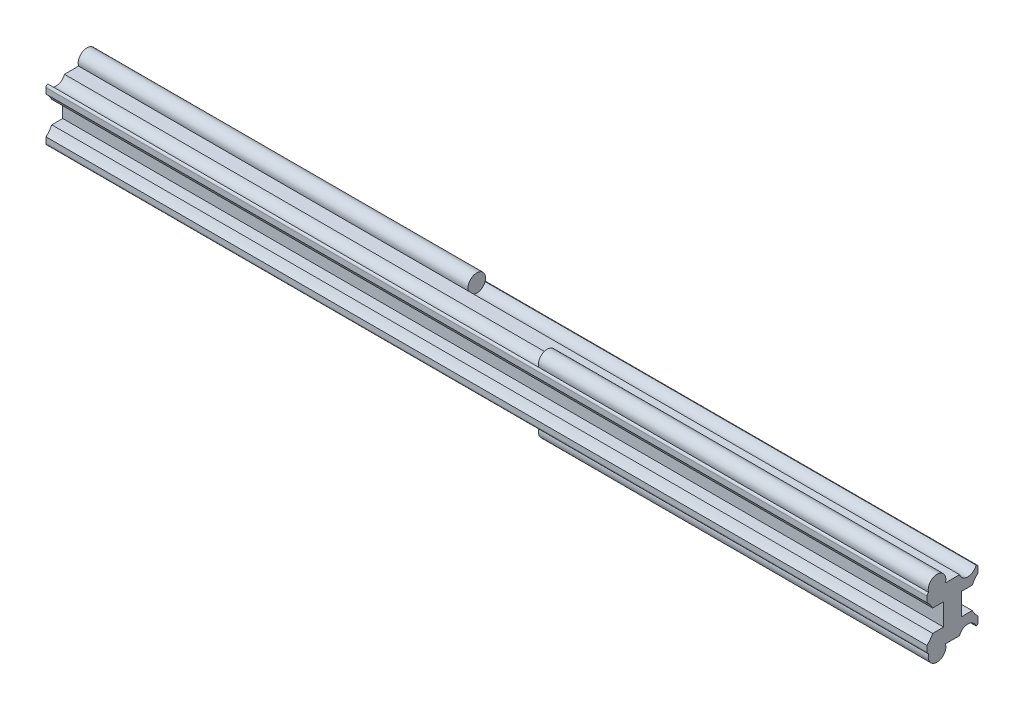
ISO-10303-21;
HEADER;
FILE_DESCRIPTION(('STEP AP214'),'2;1');
FILE_NAME('part.step','',(''),(''),'','','');
FILE_SCHEMA(('AUTOMOTIVE_DESIGN { 1 0 10303 214 1 1 1 1 }'));
ENDSEC;
DATA;
#1=APPLICATION_CONTEXT('core data for automotive mechanical design processes');
#2=APPLICATION_PROTOCOL_DEFINITION('international standard','automotive_design',2000,#1);
#3=PRODUCT_CONTEXT('',#1,'mechanical');
#4=PRODUCT('Part','Part','',(#3));
#5=PRODUCT_RELATED_PRODUCT_CATEGORY('part','',(#4));
#6=PRODUCT_DEFINITION_FORMATION('','',#4);
#7=PRODUCT_DEFINITION_CONTEXT('part definition',#1,'design');
#8=PRODUCT_DEFINITION('design','',#6,#7);
#9=PRODUCT_DEFINITION_SHAPE('','',#8);
#10=(LENGTH_UNIT() NAMED_UNIT(*) SI_UNIT(.MILLI.,.METRE.));
#11=(NAMED_UNIT(*) PLANE_ANGLE_UNIT() SI_UNIT($,.RADIAN.));
#12=(NAMED_UNIT(*) SI_UNIT($,.STERADIAN.) SOLID_ANGLE_UNIT());
#13=UNCERTAINTY_MEASURE_WITH_UNIT(LENGTH_MEASURE(1.E-05),#10,'distance_accuracy_value','');
#14=(GEOMETRIC_REPRESENTATION_CONTEXT(3) GLOBAL_UNCERTAINTY_ASSIGNED_CONTEXT((#13)) GLOBAL_UNIT_ASSIGNED_CONTEXT((#10,
#11,#12)) REPRESENTATION_CONTEXT('',''));
#15=CARTESIAN_POINT('',(0.,0.,0.));
#16=DIRECTION('',(0.,0.,1.));
#17=DIRECTION('',(1.,0.,0.));
#18=AXIS2_PLACEMENT_3D('',#15,#16,#17);
#19=CARTESIAN_POINT('',(40.,-6.65,3.5));
#20=DIRECTION('',(-1.,0.,0.));
#21=DIRECTION('',(0.,0.,1.));
#22=AXIS2_PLACEMENT_3D('',#19,#20,#21);
#23=CYLINDRICAL_SURFACE('',#22,2.);
#24=CARTESIAN_POINT('',(11.5,-6.65,3.5));
#25=DIRECTION('',(1.,0.,0.));
#26=DIRECTION('',(0.,0.,-1.));
#27=AXIS2_PLACEMENT_3D('',#24,#25,#26);
#28=CIRCLE('',#27,2.);
#29=CARTESIAN_POINT('',(11.5,-6.,1.60857196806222));
#30=VERTEX_POINT('',#29);
#31=CARTESIAN_POINT('',(11.5,-5.99207212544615,5.38868496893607));
#32=VERTEX_POINT('',#31);
#33=EDGE_CURVE('E29',#30,#32,#28,.T.);
#34=ORIENTED_EDGE('',*,*,#33,.T.);
#35=DIRECTION('',(-1.,0.,0.));
#36=VECTOR('',#35,1.);
#37=CARTESIAN_POINT('',(0.,-5.99207212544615,5.38868496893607));
#38=LINE('',#37,#36);
#39=CARTESIAN_POINT('',(-100.,-5.99207212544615,5.38868496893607));
#40=VERTEX_POINT('',#39);
#41=EDGE_CURVE('E217',#32,#40,#38,.T.);
#42=ORIENTED_EDGE('',*,*,#41,.T.);
#43=CARTESIAN_POINT('',(-100.,-6.65,3.5));
#44=DIRECTION('',(1.,0.,0.));
#45=DIRECTION('',(0.,0.,1.));
#46=AXIS2_PLACEMENT_3D('',#43,#44,#45);
#47=CIRCLE('',#46,2.);
#48=CARTESIAN_POINT('',(-100.,-6.,1.60857196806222));
#49=VERTEX_POINT('',#48);
#50=EDGE_CURVE('E258',#49,#40,#47,.T.);
#51=ORIENTED_EDGE('',*,*,#50,.F.);
#52=DIRECTION('',(-1.,0.,0.));
#53=VECTOR('',#52,1.);
#54=CARTESIAN_POINT('',(40.,-6.,1.60857196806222));
#55=LINE('',#54,#53);
#56=EDGE_CURVE('E318',#49,#30,#55,.F.);
#57=ORIENTED_EDGE('',*,*,#56,.T.);
#58=EDGE_LOOP('',(#34,#42,#51,#57));
#59=FACE_BOUND('',#58,.T.);
#60=ADVANCED_FACE('F14',(#59),#23,.F.);
#61=CARTESIAN_POINT('',(40.,6.65,3.5));
#62=DIRECTION('',(-1.,0.,0.));
#63=DIRECTION('',(0.,0.,1.));
#64=AXIS2_PLACEMENT_3D('',#61,#62,#63);
#65=CYLINDRICAL_SURFACE('',#64,2.);
#66=CARTESIAN_POINT('',(11.5,6.65,3.5));
#67=DIRECTION('',(1.,0.,0.));
#68=DIRECTION('',(0.,0.,-1.));
#69=AXIS2_PLACEMENT_3D('',#66,#67,#68);
#70=CIRCLE('',#69,2.);
#71=CARTESIAN_POINT('',(11.5,5.99207212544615,5.38868496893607));
#72=VERTEX_POINT('',#71);
#73=CARTESIAN_POINT('',(11.5,6.,1.60857196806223));
#74=VERTEX_POINT('',#73);
#75=EDGE_CURVE('E230',#72,#74,#70,.T.);
#76=ORIENTED_EDGE('',*,*,#75,.T.);
#77=DIRECTION('',(-1.,0.,0.));
#78=VECTOR('',#77,1.);
#79=CARTESIAN_POINT('',(40.,6.,1.60857196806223));
#80=LINE('',#79,#78);
#81=CARTESIAN_POINT('',(-100.,6.,1.60857196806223));
#82=VERTEX_POINT('',#81);
#83=EDGE_CURVE('E22',#74,#82,#80,.T.);
#84=ORIENTED_EDGE('',*,*,#83,.T.);
#85=CARTESIAN_POINT('',(-100.,6.65,3.5));
#86=DIRECTION('',(1.,0.,0.));
#87=DIRECTION('',(0.,0.,1.));
#88=AXIS2_PLACEMENT_3D('',#85,#86,#87);
#89=CIRCLE('',#88,2.);
#90=CARTESIAN_POINT('',(-100.,5.99207212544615,5.38868496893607));
#91=VERTEX_POINT('',#90);
#92=EDGE_CURVE('E288',#91,#82,#89,.T.);
#93=ORIENTED_EDGE('',*,*,#92,.F.);
#94=DIRECTION('',(-1.,0.,0.));
#95=VECTOR('',#94,1.);
#96=CARTESIAN_POINT('',(0.,5.99207212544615,5.38868496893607));
#97=LINE('',#96,#95);
#98=EDGE_CURVE('E382',#91,#72,#97,.F.);
#99=ORIENTED_EDGE('',*,*,#98,.T.);
#100=EDGE_LOOP('',(#76,#84,#93,#99));
#101=FACE_BOUND('',#100,.T.);
#102=ADVANCED_FACE('F488',(#101),#65,.F.);
#103=CARTESIAN_POINT('',(40.,-6.65,-3.5));
#104=DIRECTION('',(-1.,0.,0.));
#105=DIRECTION('',(0.,0.,1.));
#106=AXIS2_PLACEMENT_3D('',#103,#104,#105);
#107=CYLINDRICAL_SURFACE('',#106,2.);
#108=CARTESIAN_POINT('',(-11.5,-6.65,-3.5));
#109=DIRECTION('',(-1.,0.,0.));
#110=DIRECTION('',(0.,0.,1.));
#111=AXIS2_PLACEMENT_3D('',#108,#109,#110);
#112=CIRCLE('',#111,2.);
#113=CARTESIAN_POINT('',(-11.5,-6.,-1.60857196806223));
#114=VERTEX_POINT('',#113);
#115=CARTESIAN_POINT('',(-11.5,-5.99207212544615,-5.38868496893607));
#116=VERTEX_POINT('',#115);
#117=EDGE_CURVE('E239',#114,#116,#112,.T.);
#118=ORIENTED_EDGE('',*,*,#117,.T.);
#119=DIRECTION('',(-1.,0.,0.));
#120=VECTOR('',#119,1.);
#121=CARTESIAN_POINT('',(0.,-5.99207212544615,-5.38868496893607));
#122=LINE('',#121,#120);
#123=CARTESIAN_POINT('',(100.,-5.99207212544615,-5.38868496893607));
#124=VERTEX_POINT('',#123);
#125=EDGE_CURVE('E376',#116,#124,#122,.F.);
#126=ORIENTED_EDGE('',*,*,#125,.T.);
#127=CARTESIAN_POINT('',(100.,-6.65,-3.5));
#128=DIRECTION('',(1.,0.,0.));
#129=DIRECTION('',(0.,0.,1.));
#130=AXIS2_PLACEMENT_3D('',#127,#128,#129);
#131=CIRCLE('',#130,2.);
#132=CARTESIAN_POINT('',(100.,-6.,-1.60857196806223));
#133=VERTEX_POINT('',#132);
#134=EDGE_CURVE('E321',#124,#133,#131,.T.);
#135=ORIENTED_EDGE('',*,*,#134,.T.);
#136=DIRECTION('',(-1.,0.,0.));
#137=VECTOR('',#136,1.);
#138=CARTESIAN_POINT('',(40.,-6.,-1.60857196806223));
#139=LINE('',#138,#137);
#140=EDGE_CURVE('E417',#133,#114,#139,.T.);
#141=ORIENTED_EDGE('',*,*,#140,.T.);
#142=EDGE_LOOP('',(#118,#126,#135,#141));
#143=FACE_BOUND('',#142,.T.);
#144=ADVANCED_FACE('F494',(#143),#107,.F.);
#145=CARTESIAN_POINT('',(40.,6.65,-3.5));
#146=DIRECTION('',(-1.,0.,0.));
#147=DIRECTION('',(0.,0.,1.));
#148=AXIS2_PLACEMENT_3D('',#145,#146,#147);
#149=CYLINDRICAL_SURFACE('',#148,2.);
#150=CARTESIAN_POINT('',(-11.5,6.65,-3.5));
#151=DIRECTION('',(-1.,0.,0.));
#152=DIRECTION('',(0.,0.,1.));
#153=AXIS2_PLACEMENT_3D('',#150,#151,#152);
#154=CIRCLE('',#153,2.);
#155=CARTESIAN_POINT('',(-11.5,5.99207212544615,-5.38868496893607));
#156=VERTEX_POINT('',#155);
#157=CARTESIAN_POINT('',(-11.5,6.,-1.60857196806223));
#158=VERTEX_POINT('',#157);
#159=EDGE_CURVE('E245',#156,#158,#154,.T.);
#160=ORIENTED_EDGE('',*,*,#159,.T.);
#161=DIRECTION('',(-1.,0.,0.));
#162=VECTOR('',#161,1.);
#163=CARTESIAN_POINT('',(40.,6.,-1.60857196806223));
#164=LINE('',#163,#162);
#165=CARTESIAN_POINT('',(100.,6.,-1.60857196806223));
#166=VERTEX_POINT('',#165);
#167=EDGE_CURVE('E379',#158,#166,#164,.F.);
#168=ORIENTED_EDGE('',*,*,#167,.T.);
#169=CARTESIAN_POINT('',(100.,6.65,-3.5));
#170=DIRECTION('',(1.,0.,0.));
#171=DIRECTION('',(0.,0.,1.));
#172=AXIS2_PLACEMENT_3D('',#169,#170,#171);
#173=CIRCLE('',#172,2.);
#174=CARTESIAN_POINT('',(100.,5.99207212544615,-5.38868496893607));
#175=VERTEX_POINT('',#174);
#176=EDGE_CURVE('E349',#166,#175,#173,.T.);
#177=ORIENTED_EDGE('',*,*,#176,.T.);
#178=DIRECTION('',(-1.,0.,0.));
#179=VECTOR('',#178,1.);
#180=CARTESIAN_POINT('',(0.,5.99207212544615,-5.38868496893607));
#181=LINE('',#180,#179);
#182=EDGE_CURVE('E420',#175,#156,#181,.T.);
#183=ORIENTED_EDGE('',*,*,#182,.T.);
#184=EDGE_LOOP('',(#160,#168,#177,#183));
#185=FACE_BOUND('',#184,.T.);
#186=ADVANCED_FACE('F501',(#185),#149,.F.);
#187=CARTESIAN_POINT('',(-100.,-5.5,-5.3000000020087));
#188=DIRECTION('',(-1.,0.,0.));
#189=DIRECTION('',(0.,0.,1.));
#190=AXIS2_PLACEMENT_3D('',#187,#188,#189);
#191=PLANE('',#190);
#192=CARTESIAN_POINT('',(-100.,-5.5,-5.3000000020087));
#193=DIRECTION('',(-1.,0.,0.));
#194=DIRECTION('',(0.,0.,1.));
#195=AXIS2_PLACEMENT_3D('',#192,#193,#194);
#196=CIRCLE('',#195,0.5);
#197=CARTESIAN_POINT('',(-100.,-5.5,-5.8000000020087));
#198=VERTEX_POINT('',#197);
#199=CARTESIAN_POINT('',(-100.,-5.99207212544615,-5.38868496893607));
#200=VERTEX_POINT('',#199);
#201=EDGE_CURVE('E251',#198,#200,#196,.T.);
#202=ORIENTED_EDGE('',*,*,#201,.T.);
#203=CARTESIAN_POINT('',(-100.,-6.65,-3.5));
#204=DIRECTION('',(-1.,0.,0.));
#205=DIRECTION('',(0.,0.,1.));
#206=AXIS2_PLACEMENT_3D('',#203,#204,#205);
#207=CIRCLE('',#206,2.);
#208=CARTESIAN_POINT('',(-100.,-6.,-1.60857196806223));
#209=VERTEX_POINT('',#208);
#210=EDGE_CURVE('E238',#200,#209,#207,.T.);
#211=ORIENTED_EDGE('',*,*,#210,.T.);
#212=DIRECTION('',(0.,0.,1.));
#213=VECTOR('',#212,1.);
#214=CARTESIAN_POINT('',(-100.,-6.,-1.60857196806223));
#215=LINE('',#214,#213);
#216=EDGE_CURVE('E254',#209,#49,#215,.T.);
#217=ORIENTED_EDGE('',*,*,#216,.T.);
#218=ORIENTED_EDGE('',*,*,#50,.T.);
#219=CARTESIAN_POINT('',(-100.,-5.5,5.3000000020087));
#220=DIRECTION('',(-1.,0.,0.));
#221=DIRECTION('',(0.,0.,1.));
#222=AXIS2_PLACEMENT_3D('',#219,#220,#221);
#223=CIRCLE('',#222,0.5);
#224=CARTESIAN_POINT('',(-100.,-5.5,5.8000000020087));
#225=VERTEX_POINT('',#224);
#226=EDGE_CURVE('E261',#40,#225,#223,.T.);
#227=ORIENTED_EDGE('',*,*,#226,.T.);
#228=DIRECTION('',(0.,1.,0.));
#229=VECTOR('',#228,1.);
#230=CARTESIAN_POINT('',(-100.,-5.5,5.8000000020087));
#231=LINE('',#230,#229);
#232=CARTESIAN_POINT('',(-100.,-4.1995699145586,5.80000000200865));
#233=VERTEX_POINT('',#232);
#234=EDGE_CURVE('E264',#225,#233,#231,.T.);
#235=ORIENTED_EDGE('',*,*,#234,.T.);
#236=CARTESIAN_POINT('',(-100.,0.00400000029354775,9.49999999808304));
#237=DIRECTION('',(1.,0.,0.));
#238=DIRECTION('',(0.,0.,1.));
#239=AXIS2_PLACEMENT_3D('',#236,#237,#238);
#240=CIRCLE('',#239,5.6);
#241=CARTESIAN_POINT('',(-100.,-2.49600003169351,4.48901208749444));
#242=VERTEX_POINT('',#241);
#243=EDGE_CURVE('E267',#233,#242,#240,.T.);
#244=ORIENTED_EDGE('',*,*,#243,.T.);
#245=DIRECTION('',(0.,1.2851330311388E-08,-1.));
#246=VECTOR('',#245,1.);
#247=CARTESIAN_POINT('',(-100.,-2.49600003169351,4.48901208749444));
#248=LINE('',#247,#246);
#249=CARTESIAN_POINT('',(-100.,-2.4959999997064,1.99999999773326));
#250=VERTEX_POINT('',#249);
#251=EDGE_CURVE('E270',#242,#250,#248,.T.);
#252=ORIENTED_EDGE('',*,*,#251,.T.);
#253=DIRECTION('',(0.,1.,0.));
#254=VECTOR('',#253,1.);
#255=CARTESIAN_POINT('',(-100.,-2.4959999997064,1.99999999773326));
#256=LINE('',#255,#254);
#257=CARTESIAN_POINT('',(-100.,2.4959999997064,1.99999999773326));
#258=VERTEX_POINT('',#257);
#259=EDGE_CURVE('E273',#250,#258,#256,.T.);
#260=ORIENTED_EDGE('',*,*,#259,.T.);
#261=DIRECTION('',(0.,1.28513155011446E-08,1.));
#262=VECTOR('',#261,1.);
#263=CARTESIAN_POINT('',(-100.,2.4959999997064,1.99999999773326));
#264=LINE('',#263,#262);
#265=CARTESIAN_POINT('',(-100.,2.49600003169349,4.48901208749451));
#266=VERTEX_POINT('',#265);
#267=EDGE_CURVE('E276',#258,#266,#264,.T.);
#268=ORIENTED_EDGE('',*,*,#267,.T.);
#269=CARTESIAN_POINT('',(-100.,-0.00400000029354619,9.49999999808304));
#270=DIRECTION('',(1.,0.,0.));
#271=DIRECTION('',(0.,0.,1.));
#272=AXIS2_PLACEMENT_3D('',#269,#270,#271);
#273=CIRCLE('',#272,5.6);
#274=CARTESIAN_POINT('',(-100.,4.19956991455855,5.8000000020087));
#275=VERTEX_POINT('',#274);
#276=EDGE_CURVE('E279',#266,#275,#273,.T.);
#277=ORIENTED_EDGE('',*,*,#276,.T.);
#278=DIRECTION('',(0.,1.,0.));
#279=VECTOR('',#278,1.);
#280=CARTESIAN_POINT('',(-100.,4.19956991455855,5.8000000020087));
#281=LINE('',#280,#279);
#282=CARTESIAN_POINT('',(-100.,5.5,5.8000000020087));
#283=VERTEX_POINT('',#282);
#284=EDGE_CURVE('E282',#275,#283,#281,.T.);
#285=ORIENTED_EDGE('',*,*,#284,.T.);
#286=CARTESIAN_POINT('',(-100.,5.5,5.3000000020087));
#287=DIRECTION('',(-1.,0.,0.));
#288=DIRECTION('',(0.,0.,1.));
#289=AXIS2_PLACEMENT_3D('',#286,#287,#288);
#290=CIRCLE('',#289,0.5);
#291=EDGE_CURVE('E285',#283,#91,#290,.T.);
#292=ORIENTED_EDGE('',*,*,#291,.T.);
#293=ORIENTED_EDGE('',*,*,#92,.T.);
#294=DIRECTION('',(0.,0.,-1.));
#295=VECTOR('',#294,1.);
#296=CARTESIAN_POINT('',(-100.,6.,1.60857196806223));
#297=LINE('',#296,#295);
#298=CARTESIAN_POINT('',(-100.,6.,-1.60857196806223));
#299=VERTEX_POINT('',#298);
#300=EDGE_CURVE('E291',#82,#299,#297,.T.);
#301=ORIENTED_EDGE('',*,*,#300,.T.);
#302=CARTESIAN_POINT('',(-100.,6.65,-3.5));
#303=DIRECTION('',(-1.,0.,0.));
#304=DIRECTION('',(0.,0.,1.));
#305=AXIS2_PLACEMENT_3D('',#302,#303,#304);
#306=CIRCLE('',#305,2.);
#307=CARTESIAN_POINT('',(-100.,5.99207212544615,-5.38868496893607));
#308=VERTEX_POINT('',#307);
#309=EDGE_CURVE('E242',#299,#308,#306,.T.);
#310=ORIENTED_EDGE('',*,*,#309,.T.);
#311=CARTESIAN_POINT('',(-100.,5.5,-5.3000000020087));
#312=DIRECTION('',(-1.,0.,0.));
#313=DIRECTION('',(0.,0.,1.));
#314=AXIS2_PLACEMENT_3D('',#311,#312,#313);
#315=CIRCLE('',#314,0.5);
#316=CARTESIAN_POINT('',(-100.,5.5,-5.8000000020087));
#317=VERTEX_POINT('',#316);
#318=EDGE_CURVE('E294',#308,#317,#315,.T.);
#319=ORIENTED_EDGE('',*,*,#318,.T.);
#320=DIRECTION('',(0.,-1.,0.));
#321=VECTOR('',#320,1.);
#322=CARTESIAN_POINT('',(-100.,5.5,-5.8000000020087));
#323=LINE('',#322,#321);
#324=CARTESIAN_POINT('',(-100.,4.1995699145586,-5.80000000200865));
#325=VERTEX_POINT('',#324);
#326=EDGE_CURVE('E297',#317,#325,#323,.T.);
#327=ORIENTED_EDGE('',*,*,#326,.T.);
#328=CARTESIAN_POINT('',(-100.,-0.00400000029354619,-9.49999999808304));
#329=DIRECTION('',(1.,0.,0.));
#330=DIRECTION('',(0.,0.,1.));
#331=AXIS2_PLACEMENT_3D('',#328,#329,#330);
#332=CIRCLE('',#331,5.6);
#333=CARTESIAN_POINT('',(-100.,2.49600003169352,-4.48901208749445));
#334=VERTEX_POINT('',#333);
#335=EDGE_CURVE('E300',#325,#334,#332,.T.);
#336=ORIENTED_EDGE('',*,*,#335,.T.);
#337=DIRECTION('',(0.,-1.28513315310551E-08,1.));
#338=VECTOR('',#337,1.);
#339=CARTESIAN_POINT('',(-100.,2.49600003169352,-4.48901208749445));
#340=LINE('',#339,#338);
#341=CARTESIAN_POINT('',(-100.,2.4959999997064,-1.99999999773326));
#342=VERTEX_POINT('',#341);
#343=EDGE_CURVE('E303',#334,#342,#340,.T.);
#344=ORIENTED_EDGE('',*,*,#343,.T.);
#345=DIRECTION('',(0.,-1.,0.));
#346=VECTOR('',#345,1.);
#347=CARTESIAN_POINT('',(-100.,2.4959999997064,-1.99999999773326));
#348=LINE('',#347,#346);
#349=CARTESIAN_POINT('',(-100.,-2.4959999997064,-1.99999999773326));
#350=VERTEX_POINT('',#349);
#351=EDGE_CURVE('E306',#342,#350,#348,.T.);
#352=ORIENTED_EDGE('',*,*,#351,.T.);
#353=DIRECTION('',(0.,-1.28513155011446E-08,-1.));
#354=VECTOR('',#353,1.);
#355=CARTESIAN_POINT('',(-100.,-2.4959999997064,-1.99999999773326));
#356=LINE('',#355,#354);
#357=CARTESIAN_POINT('',(-100.,-2.49600003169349,-4.48901208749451));
#358=VERTEX_POINT('',#357);
#359=EDGE_CURVE('E309',#350,#358,#356,.T.);
#360=ORIENTED_EDGE('',*,*,#359,.T.);
#361=CARTESIAN_POINT('',(-100.,0.00400000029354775,-9.49999999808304));
#362=DIRECTION('',(1.,0.,0.));
#363=DIRECTION('',(0.,0.,1.));
#364=AXIS2_PLACEMENT_3D('',#361,#362,#363);
#365=CIRCLE('',#364,5.6);
#366=CARTESIAN_POINT('',(-100.,-4.19956991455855,-5.8000000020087));
#367=VERTEX_POINT('',#366);
#368=EDGE_CURVE('E312',#358,#367,#365,.T.);
#369=ORIENTED_EDGE('',*,*,#368,.T.);
#370=DIRECTION('',(0.,-1.,0.));
#371=VECTOR('',#370,1.);
#372=CARTESIAN_POINT('',(-100.,-4.19956991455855,-5.8000000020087));
#373=LINE('',#372,#371);
#374=EDGE_CURVE('E315',#367,#198,#373,.T.);
#375=ORIENTED_EDGE('',*,*,#374,.T.);
#376=EDGE_LOOP('',(#202,#211,#217,#218,#227,#235,#244,#252,#260,#268,#277,#285,#292,#293,#301,
#310,#319,#327,#336,#344,#352,#360,#369,#375));
#377=FACE_BOUND('',#376,.T.);
#378=ADVANCED_FACE('F435',(#377),#191,.T.);
#379=CARTESIAN_POINT('',(-40.,5.24599995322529,-5.80000000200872));
#380=DIRECTION('',(0.,0.,1.));
#381=DIRECTION('',(0.,1.,0.));
#382=AXIS2_PLACEMENT_3D('',#379,#380,#381);
#383=PLANE('',#382);
#384=DIRECTION('',(1.,0.,0.));
#385=VECTOR('',#384,1.);
#386=CARTESIAN_POINT('',(-40.,4.19956991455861,-5.80000000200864));
#387=LINE('',#386,#385);
#388=CARTESIAN_POINT('',(100.,4.1995699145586,-5.80000000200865));
#389=VERTEX_POINT('',#388);
#390=EDGE_CURVE('E415',#325,#389,#387,.T.);
#391=ORIENTED_EDGE('',*,*,#390,.F.);
#392=ORIENTED_EDGE('',*,*,#326,.F.);
#393=DIRECTION('',(-1.,0.,0.));
#394=VECTOR('',#393,1.);
#395=CARTESIAN_POINT('',(51.7056202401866,5.5,-5.8000000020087));
#396=LINE('',#395,#394);
#397=CARTESIAN_POINT('',(100.,5.5,-5.8000000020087));
#398=VERTEX_POINT('',#397);
#399=EDGE_CURVE('E390',#398,#317,#396,.T.);
#400=ORIENTED_EDGE('',*,*,#399,.F.);
#401=DIRECTION('',(0.,-1.,0.));
#402=VECTOR('',#401,1.);
#403=CARTESIAN_POINT('',(100.,5.5,-5.8000000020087));
#404=LINE('',#403,#402);
#405=EDGE_CURVE('E355',#398,#389,#404,.T.);
#406=ORIENTED_EDGE('',*,*,#405,.T.);
#407=EDGE_LOOP('',(#391,#392,#400,#406));
#408=FACE_BOUND('',#407,.T.);
#409=ADVANCED_FACE('F16',(#408),#383,.F.);
#410=CARTESIAN_POINT('',(-40.,-0.00400000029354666,-9.49999999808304));
#411=DIRECTION('',(1.,0.,0.));
#412=DIRECTION('',(0.,0.,-1.));
#413=AXIS2_PLACEMENT_3D('',#410,#411,#412);
#414=CYLINDRICAL_SURFACE('',#413,5.6);
#415=ORIENTED_EDGE('',*,*,#390,.T.);
#416=CARTESIAN_POINT('',(100.,-0.00400000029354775,-9.49999999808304));
#417=DIRECTION('',(1.,0.,0.));
#418=DIRECTION('',(0.,0.,1.));
#419=AXIS2_PLACEMENT_3D('',#416,#417,#418);
#420=CIRCLE('',#419,5.6);
#421=CARTESIAN_POINT('',(100.,2.49600003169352,-4.48901208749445));
#422=VERTEX_POINT('',#421);
#423=EDGE_CURVE('E358',#389,#422,#420,.T.);
#424=ORIENTED_EDGE('',*,*,#423,.T.);
#425=DIRECTION('',(1.,0.,0.));
#426=VECTOR('',#425,1.);
#427=CARTESIAN_POINT('',(-40.,2.49600003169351,-4.48901208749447));
#428=LINE('',#427,#426);
#429=EDGE_CURVE('E413',#334,#422,#428,.T.);
#430=ORIENTED_EDGE('',*,*,#429,.F.);
#431=ORIENTED_EDGE('',*,*,#335,.F.);
#432=EDGE_LOOP('',(#415,#424,#430,#431));
#433=FACE_BOUND('',#432,.T.);
#434=ADVANCED_FACE('F441',(#433),#414,.F.);
#435=CARTESIAN_POINT('',(-40.,2.49600003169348,-4.48901208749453));
#436=DIRECTION('',(0.,1.,1.28513155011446E-08));
#437=DIRECTION('',(0.,1.28513155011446E-08,-1.));
#438=AXIS2_PLACEMENT_3D('',#435,#436,#437);
#439=PLANE('',#438);
#440=ORIENTED_EDGE('',*,*,#429,.T.);
#441=DIRECTION('',(0.,-1.28513315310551E-08,1.));
#442=VECTOR('',#441,1.);
#443=CARTESIAN_POINT('',(100.,2.49600003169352,-4.48901208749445));
#444=LINE('',#443,#442);
#445=CARTESIAN_POINT('',(100.,2.4959999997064,-1.99999999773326));
#446=VERTEX_POINT('',#445);
#447=EDGE_CURVE('E361',#422,#446,#444,.T.);
#448=ORIENTED_EDGE('',*,*,#447,.T.);
#449=DIRECTION('',(1.,0.,0.));
#450=VECTOR('',#449,1.);
#451=CARTESIAN_POINT('',(-40.,2.4959999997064,-1.99999999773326));
#452=LINE('',#451,#450);
#453=EDGE_CURVE('E411',#342,#446,#452,.T.);
#454=ORIENTED_EDGE('',*,*,#453,.F.);
#455=ORIENTED_EDGE('',*,*,#343,.F.);
#456=EDGE_LOOP('',(#440,#448,#454,#455));
#457=FACE_BOUND('',#456,.T.);
#458=ADVANCED_FACE('F446',(#457),#439,.F.);
#459=CARTESIAN_POINT('',(-40.,2.4959999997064,-1.99999999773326));
#460=DIRECTION('',(0.,0.,1.));
#461=DIRECTION('',(1.,0.,0.));
#462=AXIS2_PLACEMENT_3D('',#459,#460,#461);
#463=PLANE('',#462);
#464=ORIENTED_EDGE('',*,*,#453,.T.);
#465=DIRECTION('',(0.,-1.,0.));
#466=VECTOR('',#465,1.);
#467=CARTESIAN_POINT('',(100.,2.4959999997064,-1.99999999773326));
#468=LINE('',#467,#466);
#469=CARTESIAN_POINT('',(100.,-2.4959999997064,-1.99999999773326));
#470=VERTEX_POINT('',#469);
#471=EDGE_CURVE('E364',#446,#470,#468,.T.);
#472=ORIENTED_EDGE('',*,*,#471,.T.);
#473=DIRECTION('',(1.,0.,0.));
#474=VECTOR('',#473,1.);
#475=CARTESIAN_POINT('',(-40.,-2.4959999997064,-1.99999999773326));
#476=LINE('',#475,#474);
#477=EDGE_CURVE('E409',#350,#470,#476,.T.);
#478=ORIENTED_EDGE('',*,*,#477,.F.);
#479=ORIENTED_EDGE('',*,*,#351,.F.);
#480=EDGE_LOOP('',(#464,#472,#478,#479));
#481=FACE_BOUND('',#480,.T.);
#482=ADVANCED_FACE('F449',(#481),#463,.F.);
#483=CARTESIAN_POINT('',(-40.,-2.49600003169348,-4.48901208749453));
#484=DIRECTION('',(0.,-1.,1.28513155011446E-08));
#485=DIRECTION('',(0.,1.28513155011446E-08,1.));
#486=AXIS2_PLACEMENT_3D('',#483,#484,#485);
#487=PLANE('',#486);
#488=ORIENTED_EDGE('',*,*,#477,.T.);
#489=DIRECTION('',(0.,-1.28513155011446E-08,-1.));
#490=VECTOR('',#489,1.);
#491=CARTESIAN_POINT('',(100.,-2.4959999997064,-1.99999999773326));
#492=LINE('',#491,#490);
#493=CARTESIAN_POINT('',(100.,-2.49600003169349,-4.48901208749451));
#494=VERTEX_POINT('',#493);
#495=EDGE_CURVE('E367',#470,#494,#492,.T.);
#496=ORIENTED_EDGE('',*,*,#495,.T.);
#497=DIRECTION('',(1.,0.,0.));
#498=VECTOR('',#497,1.);
#499=CARTESIAN_POINT('',(-40.,-2.49600003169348,-4.48901208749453));
#500=LINE('',#499,#498);
#501=EDGE_CURVE('E407',#358,#494,#500,.T.);
#502=ORIENTED_EDGE('',*,*,#501,.F.);
#503=ORIENTED_EDGE('',*,*,#359,.F.);
#504=EDGE_LOOP('',(#488,#496,#502,#503));
#505=FACE_BOUND('',#504,.T.);
#506=ADVANCED_FACE('F454',(#505),#487,.F.);
#507=CARTESIAN_POINT('',(-40.,0.00400000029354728,-9.49999999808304));
#508=DIRECTION('',(1.,0.,0.));
#509=DIRECTION('',(0.,0.,-1.));
#510=AXIS2_PLACEMENT_3D('',#507,#508,#509);
#511=CYLINDRICAL_SURFACE('',#510,5.6);
#512=ORIENTED_EDGE('',*,*,#501,.T.);
#513=CARTESIAN_POINT('',(100.,0.00400000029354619,-9.49999999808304));
#514=DIRECTION('',(1.,0.,0.));
#515=DIRECTION('',(0.,0.,1.));
#516=AXIS2_PLACEMENT_3D('',#513,#514,#515);
#517=CIRCLE('',#516,5.6);
#518=CARTESIAN_POINT('',(100.,-4.19956991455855,-5.8000000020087));
#519=VERTEX_POINT('',#518);
#520=EDGE_CURVE('E370',#494,#519,#517,.T.);
#521=ORIENTED_EDGE('',*,*,#520,.T.);
#522=DIRECTION('',(1.,0.,0.));
#523=VECTOR('',#522,1.);
#524=CARTESIAN_POINT('',(-40.,-4.19956991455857,-5.80000000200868));
#525=LINE('',#524,#523);
#526=EDGE_CURVE('E405',#367,#519,#525,.T.);
#527=ORIENTED_EDGE('',*,*,#526,.F.);
#528=ORIENTED_EDGE('',*,*,#368,.F.);
#529=EDGE_LOOP('',(#512,#521,#527,#528));
#530=FACE_BOUND('',#529,.T.);
#531=ADVANCED_FACE('F457',(#530),#511,.F.);
#532=CARTESIAN_POINT('',(-40.,-5.24599995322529,-5.80000000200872));
#533=DIRECTION('',(0.,0.,1.));
#534=DIRECTION('',(0.,1.,0.));
#535=AXIS2_PLACEMENT_3D('',#532,#533,#534);
#536=PLANE('',#535);
#537=ORIENTED_EDGE('',*,*,#526,.T.);
#538=DIRECTION('',(0.,-1.,0.));
#539=VECTOR('',#538,1.);
#540=CARTESIAN_POINT('',(100.,-4.19956991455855,-5.8000000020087));
#541=LINE('',#540,#539);
#542=CARTESIAN_POINT('',(100.,-5.5,-5.8000000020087));
#543=VERTEX_POINT('',#542);
#544=EDGE_CURVE('E255',#519,#543,#541,.T.);
#545=ORIENTED_EDGE('',*,*,#544,.T.);
#546=DIRECTION('',(-1.,0.,0.));
#547=VECTOR('',#546,1.);
#548=CARTESIAN_POINT('',(51.7056202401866,-5.5,-5.8000000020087));
#549=LINE('',#548,#547);
#550=EDGE_CURVE('E385',#543,#198,#549,.T.);
#551=ORIENTED_EDGE('',*,*,#550,.T.);
#552=ORIENTED_EDGE('',*,*,#374,.F.);
#553=EDGE_LOOP('',(#537,#545,#551,#552));
#554=FACE_BOUND('',#553,.T.);
#555=ADVANCED_FACE('F462',(#554),#536,.F.);
#556=CARTESIAN_POINT('',(-40.,-5.24599995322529,5.80000000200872));
#557=DIRECTION('',(0.,0.,-1.));
#558=DIRECTION('',(0.,-1.,0.));
#559=AXIS2_PLACEMENT_3D('',#556,#557,#558);
#560=PLANE('',#559);
#561=DIRECTION('',(1.,0.,0.));
#562=VECTOR('',#561,1.);
#563=CARTESIAN_POINT('',(-40.,-4.19956991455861,5.80000000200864));
#564=LINE('',#563,#562);
#565=CARTESIAN_POINT('',(100.,-4.1995699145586,5.80000000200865));
#566=VERTEX_POINT('',#565);
#567=EDGE_CURVE('E403',#233,#566,#564,.T.);
#568=ORIENTED_EDGE('',*,*,#567,.F.);
#569=ORIENTED_EDGE('',*,*,#234,.F.);
#570=DIRECTION('',(-1.,0.,0.));
#571=VECTOR('',#570,1.);
#572=CARTESIAN_POINT('',(51.7056202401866,-5.5,5.8000000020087));
#573=LINE('',#572,#571);
#574=CARTESIAN_POINT('',(100.,-5.5,5.8000000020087));
#575=VERTEX_POINT('',#574);
#576=EDGE_CURVE('E387',#575,#225,#573,.T.);
#577=ORIENTED_EDGE('',*,*,#576,.F.);
#578=DIRECTION('',(0.,1.,0.));
#579=VECTOR('',#578,1.);
#580=CARTESIAN_POINT('',(100.,-5.5,5.8000000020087));
#581=LINE('',#580,#579);
#582=EDGE_CURVE('E209',#575,#566,#581,.T.);
#583=ORIENTED_EDGE('',*,*,#582,.T.);
#584=EDGE_LOOP('',(#568,#569,#577,#583));
#585=FACE_BOUND('',#584,.T.);
#586=ADVANCED_FACE('F544',(#585),#560,.F.);
#587=CARTESIAN_POINT('',(-40.,0.00400000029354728,9.49999999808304));
#588=DIRECTION('',(1.,0.,0.));
#589=DIRECTION('',(0.,0.,-1.));
#590=AXIS2_PLACEMENT_3D('',#587,#588,#589);
#591=CYLINDRICAL_SURFACE('',#590,5.6);
#592=ORIENTED_EDGE('',*,*,#567,.T.);
#593=CARTESIAN_POINT('',(100.,0.00400000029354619,9.49999999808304));
#594=DIRECTION('',(1.,0.,0.));
#595=DIRECTION('',(0.,0.,1.));
#596=AXIS2_PLACEMENT_3D('',#593,#594,#595);
#597=CIRCLE('',#596,5.6);
#598=CARTESIAN_POINT('',(100.,-2.49600003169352,4.48901208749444));
#599=VERTEX_POINT('',#598);
#600=EDGE_CURVE('E326',#566,#599,#597,.T.);
#601=ORIENTED_EDGE('',*,*,#600,.T.);
#602=DIRECTION('',(1.,0.,0.));
#603=VECTOR('',#602,1.);
#604=CARTESIAN_POINT('',(-40.,-2.49600003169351,4.48901208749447));
#605=LINE('',#604,#603);
#606=EDGE_CURVE('E401',#242,#599,#605,.T.);
#607=ORIENTED_EDGE('',*,*,#606,.F.);
#608=ORIENTED_EDGE('',*,*,#243,.F.);
#609=EDGE_LOOP('',(#592,#601,#607,#608));
#610=FACE_BOUND('',#609,.T.);
#611=ADVANCED_FACE('F540',(#610),#591,.F.);
#612=CARTESIAN_POINT('',(-40.,-2.49600003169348,4.48901208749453));
#613=DIRECTION('',(0.,-1.,-1.28513155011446E-08));
#614=DIRECTION('',(0.,-1.28513155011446E-08,1.));
#615=AXIS2_PLACEMENT_3D('',#612,#613,#614);
#616=PLANE('',#615);
#617=ORIENTED_EDGE('',*,*,#606,.T.);
#618=DIRECTION('',(0.,1.2851330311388E-08,-1.));
#619=VECTOR('',#618,1.);
#620=CARTESIAN_POINT('',(100.,-2.49600003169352,4.48901208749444));
#621=LINE('',#620,#619);
#622=CARTESIAN_POINT('',(100.,-2.4959999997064,1.99999999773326));
#623=VERTEX_POINT('',#622);
#624=EDGE_CURVE('E329',#599,#623,#621,.T.);
#625=ORIENTED_EDGE('',*,*,#624,.T.);
#626=DIRECTION('',(1.,0.,0.));
#627=VECTOR('',#626,1.);
#628=CARTESIAN_POINT('',(-40.,-2.4959999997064,1.99999999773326));
#629=LINE('',#628,#627);
#630=EDGE_CURVE('E399',#250,#623,#629,.T.);
#631=ORIENTED_EDGE('',*,*,#630,.F.);
#632=ORIENTED_EDGE('',*,*,#251,.F.);
#633=EDGE_LOOP('',(#617,#625,#631,#632));
#634=FACE_BOUND('',#633,.T.);
#635=ADVANCED_FACE('F536',(#634),#616,.F.);
#636=CARTESIAN_POINT('',(-40.,2.4959999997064,1.99999999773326));
#637=DIRECTION('',(0.,0.,-1.));
#638=DIRECTION('',(-1.,0.,0.));
#639=AXIS2_PLACEMENT_3D('',#636,#637,#638);
#640=PLANE('',#639);
#641=ORIENTED_EDGE('',*,*,#630,.T.);
#642=DIRECTION('',(0.,1.,0.));
#643=VECTOR('',#642,1.);
#644=CARTESIAN_POINT('',(100.,-2.4959999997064,1.99999999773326));
#645=LINE('',#644,#643);
#646=CARTESIAN_POINT('',(100.,2.4959999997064,1.99999999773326));
#647=VERTEX_POINT('',#646);
#648=EDGE_CURVE('E332',#623,#647,#645,.T.);
#649=ORIENTED_EDGE('',*,*,#648,.T.);
#650=DIRECTION('',(1.,0.,0.));
#651=VECTOR('',#650,1.);
#652=CARTESIAN_POINT('',(-40.,2.4959999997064,1.99999999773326));
#653=LINE('',#652,#651);
#654=EDGE_CURVE('E397',#258,#647,#653,.T.);
#655=ORIENTED_EDGE('',*,*,#654,.F.);
#656=ORIENTED_EDGE('',*,*,#259,.F.);
#657=EDGE_LOOP('',(#641,#649,#655,#656));
#658=FACE_BOUND('',#657,.T.);
#659=ADVANCED_FACE('F532',(#658),#640,.F.);
#660=CARTESIAN_POINT('',(-40.,2.49600003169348,4.48901208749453));
#661=DIRECTION('',(0.,1.,-1.28513155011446E-08));
#662=DIRECTION('',(0.,-1.28513155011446E-08,-1.));
#663=AXIS2_PLACEMENT_3D('',#660,#661,#662);
#664=PLANE('',#663);
#665=ORIENTED_EDGE('',*,*,#654,.T.);
#666=DIRECTION('',(0.,1.28513155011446E-08,1.));
#667=VECTOR('',#666,1.);
#668=CARTESIAN_POINT('',(100.,2.4959999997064,1.99999999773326));
#669=LINE('',#668,#667);
#670=CARTESIAN_POINT('',(100.,2.49600003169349,4.48901208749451));
#671=VERTEX_POINT('',#670);
#672=EDGE_CURVE('E335',#647,#671,#669,.T.);
#673=ORIENTED_EDGE('',*,*,#672,.T.);
#674=DIRECTION('',(1.,0.,0.));
#675=VECTOR('',#674,1.);
#676=CARTESIAN_POINT('',(-40.,2.49600003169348,4.48901208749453));
#677=LINE('',#676,#675);
#678=EDGE_CURVE('E395',#266,#671,#677,.T.);
#679=ORIENTED_EDGE('',*,*,#678,.F.);
#680=ORIENTED_EDGE('',*,*,#267,.F.);
#681=EDGE_LOOP('',(#665,#673,#679,#680));
#682=FACE_BOUND('',#681,.T.);
#683=ADVANCED_FACE('F528',(#682),#664,.F.);
#684=CARTESIAN_POINT('',(-40.,-0.00400000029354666,9.49999999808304));
#685=DIRECTION('',(1.,0.,0.));
#686=DIRECTION('',(0.,0.,-1.));
#687=AXIS2_PLACEMENT_3D('',#684,#685,#686);
#688=CYLINDRICAL_SURFACE('',#687,5.6);
#689=ORIENTED_EDGE('',*,*,#678,.T.);
#690=CARTESIAN_POINT('',(100.,-0.00400000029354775,9.49999999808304));
#691=DIRECTION('',(1.,0.,0.));
#692=DIRECTION('',(0.,0.,1.));
#693=AXIS2_PLACEMENT_3D('',#690,#691,#692);
#694=CIRCLE('',#693,5.6);
#695=CARTESIAN_POINT('',(100.,4.19956991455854,5.8000000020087));
#696=VERTEX_POINT('',#695);
#697=EDGE_CURVE('E338',#671,#696,#694,.T.);
#698=ORIENTED_EDGE('',*,*,#697,.T.);
#699=DIRECTION('',(1.,0.,0.));
#700=VECTOR('',#699,1.);
#701=CARTESIAN_POINT('',(-40.,4.19956991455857,5.80000000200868));
#702=LINE('',#701,#700);
#703=EDGE_CURVE('E392',#275,#696,#702,.T.);
#704=ORIENTED_EDGE('',*,*,#703,.F.);
#705=ORIENTED_EDGE('',*,*,#276,.F.);
#706=EDGE_LOOP('',(#689,#698,#704,#705));
#707=FACE_BOUND('',#706,.T.);
#708=ADVANCED_FACE('F524',(#707),#688,.F.);
#709=CARTESIAN_POINT('',(-40.,5.24599995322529,5.80000000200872));
#710=DIRECTION('',(0.,0.,-1.));
#711=DIRECTION('',(0.,-1.,0.));
#712=AXIS2_PLACEMENT_3D('',#709,#710,#711);
#713=PLANE('',#712);
#714=ORIENTED_EDGE('',*,*,#703,.T.);
#715=DIRECTION('',(0.,1.,0.));
#716=VECTOR('',#715,1.);
#717=CARTESIAN_POINT('',(100.,4.19956991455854,5.8000000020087));
#718=LINE('',#717,#716);
#719=CARTESIAN_POINT('',(100.,5.5,5.8000000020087));
#720=VERTEX_POINT('',#719);
#721=EDGE_CURVE('E341',#696,#720,#718,.T.);
#722=ORIENTED_EDGE('',*,*,#721,.T.);
#723=DIRECTION('',(-1.,0.,0.));
#724=VECTOR('',#723,1.);
#725=CARTESIAN_POINT('',(51.7056202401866,5.5,5.8000000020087));
#726=LINE('',#725,#724);
#727=EDGE_CURVE('E389',#720,#283,#726,.T.);
#728=ORIENTED_EDGE('',*,*,#727,.T.);
#729=ORIENTED_EDGE('',*,*,#284,.F.);
#730=EDGE_LOOP('',(#714,#722,#728,#729));
#731=FACE_BOUND('',#730,.T.);
#732=ADVANCED_FACE('F520',(#731),#713,.F.);
#733=CARTESIAN_POINT('',(51.7056202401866,5.5,5.3000000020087));
#734=DIRECTION('',(-1.,0.,0.));
#735=DIRECTION('',(0.,0.,1.));
#736=AXIS2_PLACEMENT_3D('',#733,#734,#735);
#737=CYLINDRICAL_SURFACE('',#736,0.5);
#738=ORIENTED_EDGE('',*,*,#98,.F.);
#739=ORIENTED_EDGE('',*,*,#291,.F.);
#740=ORIENTED_EDGE('',*,*,#727,.F.);
#741=CARTESIAN_POINT('',(100.,5.5,5.3000000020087));
#742=DIRECTION('',(-1.,0.,0.));
#743=DIRECTION('',(0.,0.,1.));
#744=AXIS2_PLACEMENT_3D('',#741,#742,#743);
#745=CIRCLE('',#744,0.5);
#746=CARTESIAN_POINT('',(100.,5.99207212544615,5.38868496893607));
#747=VERTEX_POINT('',#746);
#748=EDGE_CURVE('E344',#720,#747,#745,.T.);
#749=ORIENTED_EDGE('',*,*,#748,.T.);
#750=DIRECTION('',(1.,0.,0.));
#751=VECTOR('',#750,1.);
#752=CARTESIAN_POINT('',(55.75,5.99207212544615,5.38868496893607));
#753=LINE('',#752,#751);
#754=EDGE_CURVE('E232',#72,#747,#753,.T.);
#755=ORIENTED_EDGE('',*,*,#754,.F.);
#756=EDGE_LOOP('',(#738,#739,#740,#749,#755));
#757=FACE_BOUND('',#756,.T.);
#758=ADVANCED_FACE('F516',(#757),#737,.T.);
#759=CARTESIAN_POINT('',(51.7056202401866,6.,-5.3000000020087));
#760=DIRECTION('',(0.,1.,0.));
#761=DIRECTION('',(-1.,0.,0.));
#762=AXIS2_PLACEMENT_3D('',#759,#760,#761);
#763=PLANE('',#762);
#764=CARTESIAN_POINT('',(100.,6.,1.60857196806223));
#765=VERTEX_POINT('',#764);
#766=EDGE_CURVE('E9',#765,#74,#80,.T.);
#767=ORIENTED_EDGE('',*,*,#766,.F.);
#768=DIRECTION('',(0.,0.,-1.));
#769=VECTOR('',#768,1.);
#770=CARTESIAN_POINT('',(100.,6.,1.60857196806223));
#771=LINE('',#770,#769);
#772=EDGE_CURVE('E346',#765,#166,#771,.T.);
#773=ORIENTED_EDGE('',*,*,#772,.T.);
#774=ORIENTED_EDGE('',*,*,#167,.F.);
#775=EDGE_CURVE('E380',#299,#158,#164,.F.);
#776=ORIENTED_EDGE('',*,*,#775,.F.);
#777=ORIENTED_EDGE('',*,*,#300,.F.);
#778=ORIENTED_EDGE('',*,*,#83,.F.);
#779=EDGE_LOOP('',(#767,#773,#774,#776,#777,#778));
#780=FACE_BOUND('',#779,.T.);
#781=ADVANCED_FACE('F513',(#780),#763,.T.);
#782=CARTESIAN_POINT('',(51.7056202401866,5.5,-5.3000000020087));
#783=DIRECTION('',(-1.,0.,0.));
#784=DIRECTION('',(0.,0.,1.));
#785=AXIS2_PLACEMENT_3D('',#782,#783,#784);
#786=CYLINDRICAL_SURFACE('',#785,0.5);
#787=ORIENTED_EDGE('',*,*,#182,.F.);
#788=CARTESIAN_POINT('',(100.,5.5,-5.3000000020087));
#789=DIRECTION('',(-1.,0.,0.));
#790=DIRECTION('',(0.,0.,1.));
#791=AXIS2_PLACEMENT_3D('',#788,#789,#790);
#792=CIRCLE('',#791,0.5);
#793=EDGE_CURVE('E352',#175,#398,#792,.T.);
#794=ORIENTED_EDGE('',*,*,#793,.T.);
#795=ORIENTED_EDGE('',*,*,#399,.T.);
#796=ORIENTED_EDGE('',*,*,#318,.F.);
#797=EDGE_CURVE('E419',#156,#308,#181,.T.);
#798=ORIENTED_EDGE('',*,*,#797,.F.);
#799=EDGE_LOOP('',(#787,#794,#795,#796,#798));
#800=FACE_BOUND('',#799,.T.);
#801=ADVANCED_FACE('F432',(#800),#786,.T.);
#802=CARTESIAN_POINT('',(51.7056202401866,-5.5,-5.3000000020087));
#803=DIRECTION('',(-1.,0.,0.));
#804=DIRECTION('',(0.,0.,1.));
#805=AXIS2_PLACEMENT_3D('',#802,#803,#804);
#806=CYLINDRICAL_SURFACE('',#805,0.5);
#807=EDGE_CURVE('E377',#200,#116,#122,.F.);
#808=ORIENTED_EDGE('',*,*,#807,.F.);
#809=ORIENTED_EDGE('',*,*,#201,.F.);
#810=ORIENTED_EDGE('',*,*,#550,.F.);
#811=CARTESIAN_POINT('',(100.,-5.5,-5.3000000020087));
#812=DIRECTION('',(-1.,0.,0.));
#813=DIRECTION('',(0.,0.,1.));
#814=AXIS2_PLACEMENT_3D('',#811,#812,#813);
#815=CIRCLE('',#814,0.5);
#816=EDGE_CURVE('E248',#543,#124,#815,.T.);
#817=ORIENTED_EDGE('',*,*,#816,.T.);
#818=ORIENTED_EDGE('',*,*,#125,.F.);
#819=EDGE_LOOP('',(#808,#809,#810,#817,#818));
#820=FACE_BOUND('',#819,.T.);
#821=ADVANCED_FACE('F465',(#820),#806,.T.);
#822=CARTESIAN_POINT('',(51.7056202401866,-6.,-5.3000000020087));
#823=DIRECTION('',(0.,-1.,0.));
#824=DIRECTION('',(1.,0.,0.));
#825=AXIS2_PLACEMENT_3D('',#822,#823,#824);
#826=PLANE('',#825);
#827=ORIENTED_EDGE('',*,*,#140,.F.);
#828=DIRECTION('',(0.,0.,1.));
#829=VECTOR('',#828,1.);
#830=CARTESIAN_POINT('',(100.,-6.,-1.60857196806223));
#831=LINE('',#830,#829);
#832=CARTESIAN_POINT('',(100.,-6.,1.60857196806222));
#833=VERTEX_POINT('',#832);
#834=EDGE_CURVE('E211',#133,#833,#831,.T.);
#835=ORIENTED_EDGE('',*,*,#834,.T.);
#836=DIRECTION('',(1.,0.,0.));
#837=VECTOR('',#836,1.);
#838=CARTESIAN_POINT('',(11.5,-6.,1.60857196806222));
#839=LINE('',#838,#837);
#840=EDGE_CURVE('E37',#30,#833,#839,.T.);
#841=ORIENTED_EDGE('',*,*,#840,.F.);
#842=ORIENTED_EDGE('',*,*,#56,.F.);
#843=ORIENTED_EDGE('',*,*,#216,.F.);
#844=EDGE_CURVE('E221',#114,#209,#139,.T.);
#845=ORIENTED_EDGE('',*,*,#844,.F.);
#846=EDGE_LOOP('',(#827,#835,#841,#842,#843,#845));
#847=FACE_BOUND('',#846,.T.);
#848=ADVANCED_FACE('F475',(#847),#826,.T.);
#849=CARTESIAN_POINT('',(51.7056202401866,-5.5,5.3000000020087));
#850=DIRECTION('',(-1.,0.,0.));
#851=DIRECTION('',(0.,0.,1.));
#852=AXIS2_PLACEMENT_3D('',#849,#850,#851);
#853=CYLINDRICAL_SURFACE('',#852,0.5);
#854=CARTESIAN_POINT('',(100.,-5.99207212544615,5.38868496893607));
#855=VERTEX_POINT('',#854);
#856=EDGE_CURVE('E214',#855,#32,#38,.T.);
#857=ORIENTED_EDGE('',*,*,#856,.F.);
#858=CARTESIAN_POINT('',(100.,-5.5,5.3000000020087));
#859=DIRECTION('',(-1.,0.,0.));
#860=DIRECTION('',(0.,0.,1.));
#861=AXIS2_PLACEMENT_3D('',#858,#859,#860);
#862=CIRCLE('',#861,0.5);
#863=EDGE_CURVE('E200',#855,#575,#862,.T.);
#864=ORIENTED_EDGE('',*,*,#863,.T.);
#865=ORIENTED_EDGE('',*,*,#576,.T.);
#866=ORIENTED_EDGE('',*,*,#226,.F.);
#867=ORIENTED_EDGE('',*,*,#41,.F.);
#868=EDGE_LOOP('',(#857,#864,#865,#866,#867));
#869=FACE_BOUND('',#868,.T.);
#870=ADVANCED_FACE('F215',(#869),#853,.T.);
#871=CARTESIAN_POINT('',(100.,-5.5,-5.3000000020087));
#872=DIRECTION('',(-1.,0.,0.));
#873=DIRECTION('',(0.,0.,1.));
#874=AXIS2_PLACEMENT_3D('',#871,#872,#873);
#875=PLANE('',#874);
#876=ORIENTED_EDGE('',*,*,#816,.F.);
#877=ORIENTED_EDGE('',*,*,#544,.F.);
#878=ORIENTED_EDGE('',*,*,#520,.F.);
#879=ORIENTED_EDGE('',*,*,#495,.F.);
#880=ORIENTED_EDGE('',*,*,#471,.F.);
#881=ORIENTED_EDGE('',*,*,#447,.F.);
#882=ORIENTED_EDGE('',*,*,#423,.F.);
#883=ORIENTED_EDGE('',*,*,#405,.F.);
#884=ORIENTED_EDGE('',*,*,#793,.F.);
#885=ORIENTED_EDGE('',*,*,#176,.F.);
#886=ORIENTED_EDGE('',*,*,#772,.F.);
#887=CARTESIAN_POINT('',(100.,6.65,3.5));
#888=DIRECTION('',(1.,0.,0.));
#889=DIRECTION('',(0.,0.,-1.));
#890=AXIS2_PLACEMENT_3D('',#887,#888,#889);
#891=CIRCLE('',#890,2.);
#892=EDGE_CURVE('E229',#765,#747,#891,.T.);
#893=ORIENTED_EDGE('',*,*,#892,.T.);
#894=ORIENTED_EDGE('',*,*,#748,.F.);
#895=ORIENTED_EDGE('',*,*,#721,.F.);
#896=ORIENTED_EDGE('',*,*,#697,.F.);
#897=ORIENTED_EDGE('',*,*,#672,.F.);
#898=ORIENTED_EDGE('',*,*,#648,.F.);
#899=ORIENTED_EDGE('',*,*,#624,.F.);
#900=ORIENTED_EDGE('',*,*,#600,.F.);
#901=ORIENTED_EDGE('',*,*,#582,.F.);
#902=ORIENTED_EDGE('',*,*,#863,.F.);
#903=CARTESIAN_POINT('',(100.,-6.65,3.5));
#904=DIRECTION('',(1.,0.,0.));
#905=DIRECTION('',(0.,0.,-1.));
#906=AXIS2_PLACEMENT_3D('',#903,#904,#905);
#907=CIRCLE('',#906,2.);
#908=EDGE_CURVE('E206',#855,#833,#907,.T.);
#909=ORIENTED_EDGE('',*,*,#908,.T.);
#910=ORIENTED_EDGE('',*,*,#834,.F.);
#911=ORIENTED_EDGE('',*,*,#134,.F.);
#912=EDGE_LOOP('',(#876,#877,#878,#879,#880,#881,#882,#883,#884,#885,#886,#893,#894,#895,#896,
#897,#898,#899,#900,#901,#902,#909,#910,#911));
#913=FACE_BOUND('',#912,.T.);
#914=ADVANCED_FACE('F203',(#913),#875,.F.);
#915=CARTESIAN_POINT('',(-11.5,6.65,-3.5));
#916=DIRECTION('',(-1.,0.,0.));
#917=DIRECTION('',(0.,0.,1.));
#918=AXIS2_PLACEMENT_3D('',#915,#916,#917);
#919=CYLINDRICAL_SURFACE('',#918,2.);
#920=ORIENTED_EDGE('',*,*,#309,.F.);
#921=ORIENTED_EDGE('',*,*,#775,.T.);
#922=EDGE_CURVE('E249',#158,#156,#154,.T.);
#923=ORIENTED_EDGE('',*,*,#922,.T.);
#924=ORIENTED_EDGE('',*,*,#797,.T.);
#925=EDGE_LOOP('',(#920,#921,#923,#924));
#926=FACE_BOUND('',#925,.T.);
#927=ADVANCED_FACE('F427',(#926),#919,.T.);
#928=CARTESIAN_POINT('',(-11.5,6.65,-3.5));
#929=DIRECTION('',(-1.,0.,0.));
#930=DIRECTION('',(0.,0.,1.));
#931=AXIS2_PLACEMENT_3D('',#928,#929,#930);
#932=PLANE('',#931);
#933=ORIENTED_EDGE('',*,*,#159,.F.);
#934=ORIENTED_EDGE('',*,*,#922,.F.);
#935=EDGE_LOOP('',(#933,#934));
#936=FACE_BOUND('',#935,.T.);
#937=ADVANCED_FACE('F578',(#936),#932,.F.);
#938=CARTESIAN_POINT('',(-11.5,-6.65,-3.5));
#939=DIRECTION('',(-1.,0.,0.));
#940=DIRECTION('',(0.,0.,1.));
#941=AXIS2_PLACEMENT_3D('',#938,#939,#940);
#942=CYLINDRICAL_SURFACE('',#941,2.);
#943=ORIENTED_EDGE('',*,*,#210,.F.);
#944=ORIENTED_EDGE('',*,*,#807,.T.);
#945=EDGE_CURVE('E243',#116,#114,#112,.T.);
#946=ORIENTED_EDGE('',*,*,#945,.T.);
#947=ORIENTED_EDGE('',*,*,#844,.T.);
#948=EDGE_LOOP('',(#943,#944,#946,#947));
#949=FACE_BOUND('',#948,.T.);
#950=ADVANCED_FACE('F472',(#949),#942,.T.);
#951=CARTESIAN_POINT('',(-11.5,-6.65,-3.5));
#952=DIRECTION('',(-1.,0.,0.));
#953=DIRECTION('',(0.,0.,1.));
#954=AXIS2_PLACEMENT_3D('',#951,#952,#953);
#955=PLANE('',#954);
#956=ORIENTED_EDGE('',*,*,#117,.F.);
#957=ORIENTED_EDGE('',*,*,#945,.F.);
#958=EDGE_LOOP('',(#956,#957));
#959=FACE_BOUND('',#958,.T.);
#960=ADVANCED_FACE('F588',(#959),#955,.F.);
#961=CARTESIAN_POINT('',(11.5,6.65,3.5));
#962=DIRECTION('',(1.,0.,0.));
#963=DIRECTION('',(0.,0.,-1.));
#964=AXIS2_PLACEMENT_3D('',#961,#962,#963);
#965=CYLINDRICAL_SURFACE('',#964,2.);
#966=EDGE_CURVE('E233',#74,#72,#70,.T.);
#967=ORIENTED_EDGE('',*,*,#966,.T.);
#968=ORIENTED_EDGE('',*,*,#754,.T.);
#969=ORIENTED_EDGE('',*,*,#892,.F.);
#970=ORIENTED_EDGE('',*,*,#766,.T.);
#971=EDGE_LOOP('',(#967,#968,#969,#970));
#972=FACE_BOUND('',#971,.T.);
#973=ADVANCED_FACE('F593',(#972),#965,.T.);
#974=CARTESIAN_POINT('',(11.5,6.65,3.5));
#975=DIRECTION('',(1.,0.,0.));
#976=DIRECTION('',(0.,0.,-1.));
#977=AXIS2_PLACEMENT_3D('',#974,#975,#976);
#978=PLANE('',#977);
#979=ORIENTED_EDGE('',*,*,#75,.F.);
#980=ORIENTED_EDGE('',*,*,#966,.F.);
#981=EDGE_LOOP('',(#979,#980));
#982=FACE_BOUND('',#981,.T.);
#983=ADVANCED_FACE('F485',(#982),#978,.F.);
#984=CARTESIAN_POINT('',(11.5,-6.65,3.5));
#985=DIRECTION('',(1.,0.,0.));
#986=DIRECTION('',(0.,0.,-1.));
#987=AXIS2_PLACEMENT_3D('',#984,#985,#986);
#988=CYLINDRICAL_SURFACE('',#987,2.);
#989=EDGE_CURVE('E224',#32,#30,#28,.T.);
#990=ORIENTED_EDGE('',*,*,#989,.T.);
#991=ORIENTED_EDGE('',*,*,#840,.T.);
#992=ORIENTED_EDGE('',*,*,#908,.F.);
#993=ORIENTED_EDGE('',*,*,#856,.T.);
#994=EDGE_LOOP('',(#990,#991,#992,#993));
#995=FACE_BOUND('',#994,.T.);
#996=ADVANCED_FACE('F223',(#995),#988,.T.);
#997=CARTESIAN_POINT('',(11.5,-6.65,3.5));
#998=DIRECTION('',(1.,0.,0.));
#999=DIRECTION('',(0.,0.,-1.));
#1000=AXIS2_PLACEMENT_3D('',#997,#998,#999);
#1001=PLANE('',#1000);
#1002=ORIENTED_EDGE('',*,*,#33,.F.);
#1003=ORIENTED_EDGE('',*,*,#989,.F.);
#1004=EDGE_LOOP('',(#1002,#1003));
#1005=FACE_BOUND('',#1004,.T.);
#1006=ADVANCED_FACE('F477',(#1005),#1001,.F.);
#1007=CLOSED_SHELL('',(#60,#102,#144,#186,#378,#409,#434,#458,#482,#506,#531,#555,#586,#611,
#635,#659,#683,#708,#732,#758,#781,#801,#821,#848,#870,#914,#927,#937,#950,#960,#973,#983,#996,#1006));
#1008=MANIFOLD_SOLID_BREP('B1',#1007);
#1009=ADVANCED_BREP_SHAPE_REPRESENTATION('',(#18,#1008),#14);
#1010=SHAPE_DEFINITION_REPRESENTATION(#9,#1009);
ENDSEC;
END-ISO-10303-21;
